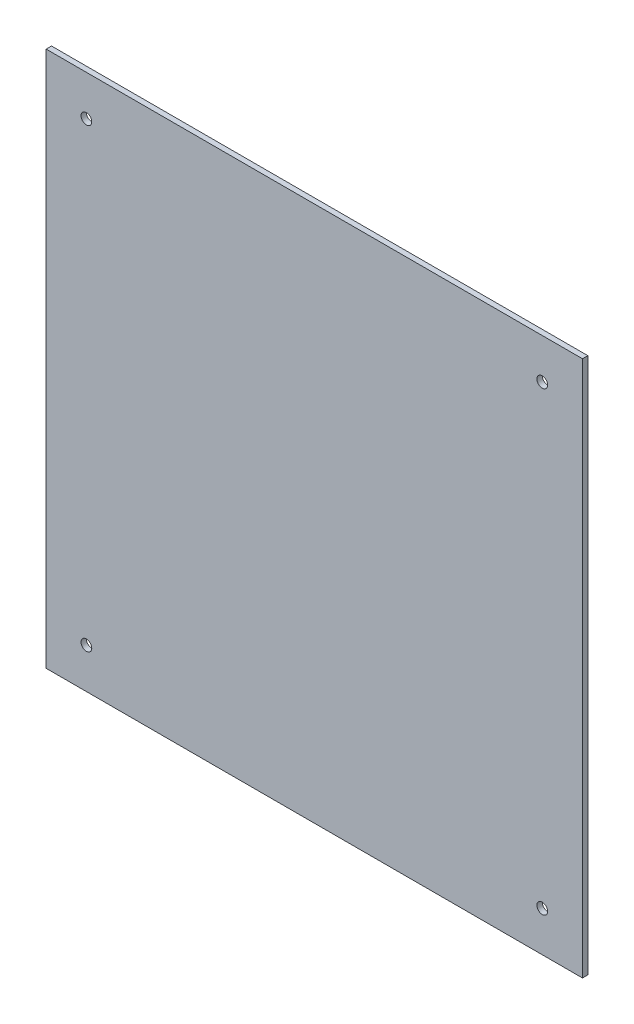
from build123d import *

# Parameters (mm, degrees)
ESQUISSE1_W      = 200
ESQUISSE1_H      = 200
ESQUISSE1_R      = 2
EXTRUSION1_DEPTH = 2


with BuildPart() as part:
    # Esquisse1 → Extrusion1 (new body)
    with BuildSketch(Plane.XY):
        with Locations((100, -100)):
            Rectangle(ESQUISSE1_W, ESQUISSE1_H)
        with Locations((15, -15)):
            Circle(ESQUISSE1_R, mode=Mode.SUBTRACT)
        with Locations((185, -15)):
            Circle(ESQUISSE1_R, mode=Mode.SUBTRACT)
        with Locations((185, -185)):
            Circle(ESQUISSE1_R, mode=Mode.SUBTRACT)
        with Locations((15, -185)):
            Circle(ESQUISSE1_R, mode=Mode.SUBTRACT)
    extrude(amount=EXTRUSION1_DEPTH)


solid = part.part
